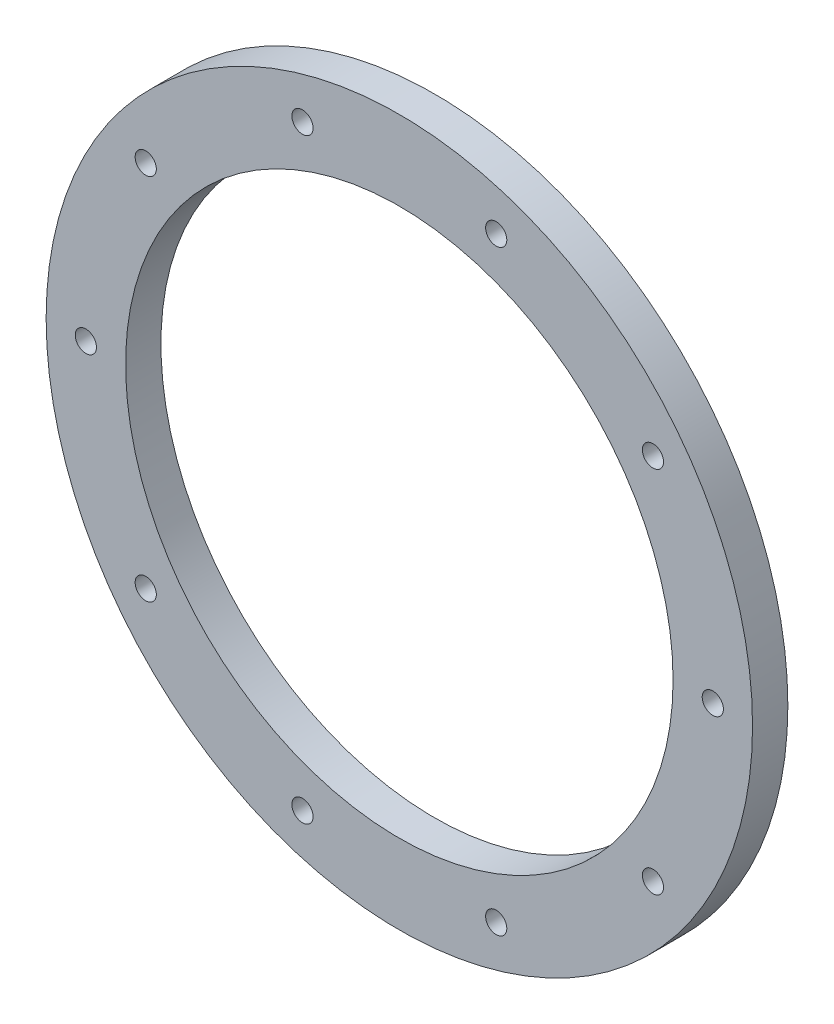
ISO-10303-21;
HEADER;
FILE_DESCRIPTION(('STEP AP214'),'2;1');
FILE_NAME('part.step','',(''),(''),'','','');
FILE_SCHEMA(('AUTOMOTIVE_DESIGN { 1 0 10303 214 1 1 1 1 }'));
ENDSEC;
DATA;
#1=APPLICATION_CONTEXT('core data for automotive mechanical design processes');
#2=APPLICATION_PROTOCOL_DEFINITION('international standard','automotive_design',2000,#1);
#3=PRODUCT_CONTEXT('',#1,'mechanical');
#4=PRODUCT('Part','Part','',(#3));
#5=PRODUCT_RELATED_PRODUCT_CATEGORY('part','',(#4));
#6=PRODUCT_DEFINITION_FORMATION('','',#4);
#7=PRODUCT_DEFINITION_CONTEXT('part definition',#1,'design');
#8=PRODUCT_DEFINITION('design','',#6,#7);
#9=PRODUCT_DEFINITION_SHAPE('','',#8);
#10=(LENGTH_UNIT() NAMED_UNIT(*) SI_UNIT(.MILLI.,.METRE.));
#11=(NAMED_UNIT(*) PLANE_ANGLE_UNIT() SI_UNIT($,.RADIAN.));
#12=(NAMED_UNIT(*) SI_UNIT($,.STERADIAN.) SOLID_ANGLE_UNIT());
#13=UNCERTAINTY_MEASURE_WITH_UNIT(LENGTH_MEASURE(1.E-05),#10,'distance_accuracy_value','');
#14=(GEOMETRIC_REPRESENTATION_CONTEXT(3) GLOBAL_UNCERTAINTY_ASSIGNED_CONTEXT((#13)) GLOBAL_UNIT_ASSIGNED_CONTEXT((#10,
#11,#12)) REPRESENTATION_CONTEXT('',''));
#15=CARTESIAN_POINT('',(0.,0.,0.));
#16=DIRECTION('',(0.,0.,1.));
#17=DIRECTION('',(1.,0.,0.));
#18=AXIS2_PLACEMENT_3D('',#15,#16,#17);
#19=CARTESIAN_POINT('',(0.,0.,20.));
#20=DIRECTION('',(0.,0.,1.));
#21=DIRECTION('',(1.,0.,0.));
#22=AXIS2_PLACEMENT_3D('',#19,#20,#21);
#23=PLANE('',#22);
#24=CARTESIAN_POINT('',(-143.600516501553,-104.331882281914,20.));
#25=DIRECTION('',(0.,0.,1.));
#26=DIRECTION('',(1.,0.,0.));
#27=AXIS2_PLACEMENT_3D('',#24,#25,#26);
#28=CIRCLE('',#27,6.00000000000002);
#29=CARTESIAN_POINT('',(-137.600516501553,-104.331882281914,20.));
#30=VERTEX_POINT('',#29);
#31=EDGE_CURVE('E84',#30,#30,#28,.T.);
#32=ORIENTED_EDGE('',*,*,#31,.F.);
#33=EDGE_LOOP('',(#32));
#34=FACE_BOUND('',#33,.T.);
#35=CARTESIAN_POINT('',(-54.8505165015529,-168.81253164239,20.));
#36=DIRECTION('',(0.,0.,1.));
#37=DIRECTION('',(1.,0.,0.));
#38=AXIS2_PLACEMENT_3D('',#35,#36,#37);
#39=CIRCLE('',#38,6.);
#40=CARTESIAN_POINT('',(-48.8505165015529,-168.81253164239,20.));
#41=VERTEX_POINT('',#40);
#42=EDGE_CURVE('E81',#41,#41,#39,.T.);
#43=ORIENTED_EDGE('',*,*,#42,.F.);
#44=EDGE_LOOP('',(#43));
#45=FACE_BOUND('',#44,.T.);
#46=CARTESIAN_POINT('',(54.8505165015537,-168.81253164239,20.));
#47=DIRECTION('',(0.,0.,1.));
#48=DIRECTION('',(1.,0.,0.));
#49=AXIS2_PLACEMENT_3D('',#46,#47,#48);
#50=CIRCLE('',#49,6.);
#51=CARTESIAN_POINT('',(60.8505165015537,-168.81253164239,20.));
#52=VERTEX_POINT('',#51);
#53=EDGE_CURVE('E78',#52,#52,#50,.T.);
#54=ORIENTED_EDGE('',*,*,#53,.F.);
#55=EDGE_LOOP('',(#54));
#56=FACE_BOUND('',#55,.T.);
#57=CARTESIAN_POINT('',(143.600516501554,-104.331882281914,20.));
#58=DIRECTION('',(0.,0.,1.));
#59=DIRECTION('',(1.,0.,0.));
#60=AXIS2_PLACEMENT_3D('',#57,#58,#59);
#61=CIRCLE('',#60,6.00000000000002);
#62=CARTESIAN_POINT('',(149.600516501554,-104.331882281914,20.));
#63=VERTEX_POINT('',#62);
#64=EDGE_CURVE('E74',#63,#63,#61,.T.);
#65=ORIENTED_EDGE('',*,*,#64,.F.);
#66=EDGE_LOOP('',(#65));
#67=FACE_BOUND('',#66,.T.);
#68=CARTESIAN_POINT('',(177.500000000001,0.,20.));
#69=DIRECTION('',(0.,0.,1.));
#70=DIRECTION('',(1.,0.,0.));
#71=AXIS2_PLACEMENT_3D('',#68,#69,#70);
#72=CIRCLE('',#71,6.00000000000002);
#73=CARTESIAN_POINT('',(183.500000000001,0.,20.));
#74=VERTEX_POINT('',#73);
#75=EDGE_CURVE('E70',#74,#74,#72,.T.);
#76=ORIENTED_EDGE('',*,*,#75,.F.);
#77=EDGE_LOOP('',(#76));
#78=FACE_BOUND('',#77,.T.);
#79=CARTESIAN_POINT('',(143.600516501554,104.331882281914,20.));
#80=DIRECTION('',(0.,0.,1.));
#81=DIRECTION('',(1.,0.,0.));
#82=AXIS2_PLACEMENT_3D('',#79,#80,#81);
#83=CIRCLE('',#82,6.00000000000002);
#84=CARTESIAN_POINT('',(149.600516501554,104.331882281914,20.));
#85=VERTEX_POINT('',#84);
#86=EDGE_CURVE('E66',#85,#85,#83,.T.);
#87=ORIENTED_EDGE('',*,*,#86,.F.);
#88=EDGE_LOOP('',(#87));
#89=FACE_BOUND('',#88,.T.);
#90=CARTESIAN_POINT('',(54.8505165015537,168.81253164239,20.));
#91=DIRECTION('',(0.,0.,1.));
#92=DIRECTION('',(1.,0.,0.));
#93=AXIS2_PLACEMENT_3D('',#90,#91,#92);
#94=CIRCLE('',#93,6.);
#95=CARTESIAN_POINT('',(60.8505165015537,168.81253164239,20.));
#96=VERTEX_POINT('',#95);
#97=EDGE_CURVE('E62',#96,#96,#94,.T.);
#98=ORIENTED_EDGE('',*,*,#97,.F.);
#99=EDGE_LOOP('',(#98));
#100=FACE_BOUND('',#99,.T.);
#101=CARTESIAN_POINT('',(-54.8505165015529,168.81253164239,20.));
#102=DIRECTION('',(0.,0.,1.));
#103=DIRECTION('',(1.,0.,0.));
#104=AXIS2_PLACEMENT_3D('',#101,#102,#103);
#105=CIRCLE('',#104,6.);
#106=CARTESIAN_POINT('',(-48.8505165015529,168.81253164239,20.));
#107=VERTEX_POINT('',#106);
#108=EDGE_CURVE('E58',#107,#107,#105,.T.);
#109=ORIENTED_EDGE('',*,*,#108,.F.);
#110=EDGE_LOOP('',(#109));
#111=FACE_BOUND('',#110,.T.);
#112=CARTESIAN_POINT('',(-143.600516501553,104.331882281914,20.));
#113=DIRECTION('',(0.,0.,1.));
#114=DIRECTION('',(1.,0.,0.));
#115=AXIS2_PLACEMENT_3D('',#112,#113,#114);
#116=CIRCLE('',#115,6.00000000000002);
#117=CARTESIAN_POINT('',(-137.600516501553,104.331882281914,20.));
#118=VERTEX_POINT('',#117);
#119=EDGE_CURVE('E54',#118,#118,#116,.T.);
#120=ORIENTED_EDGE('',*,*,#119,.F.);
#121=EDGE_LOOP('',(#120));
#122=FACE_BOUND('',#121,.T.);
#123=CARTESIAN_POINT('',(-177.5,0.,20.));
#124=DIRECTION('',(0.,0.,1.));
#125=DIRECTION('',(1.,0.,0.));
#126=AXIS2_PLACEMENT_3D('',#123,#124,#125);
#127=CIRCLE('',#126,6.00000000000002);
#128=CARTESIAN_POINT('',(-171.5,0.,20.));
#129=VERTEX_POINT('',#128);
#130=EDGE_CURVE('E53',#129,#129,#127,.T.);
#131=ORIENTED_EDGE('',*,*,#130,.F.);
#132=EDGE_LOOP('',(#131));
#133=FACE_BOUND('',#132,.T.);
#134=CARTESIAN_POINT('',(0.,0.,20.));
#135=DIRECTION('',(0.,0.,1.));
#136=DIRECTION('',(1.,0.,0.));
#137=AXIS2_PLACEMENT_3D('',#134,#135,#136);
#138=CIRCLE('',#137,200.);
#139=CARTESIAN_POINT('',(200.,0.,20.));
#140=VERTEX_POINT('',#139);
#141=EDGE_CURVE('E10',#140,#140,#138,.T.);
#142=ORIENTED_EDGE('',*,*,#141,.T.);
#143=EDGE_LOOP('',(#142));
#144=FACE_BOUND('',#143,.T.);
#145=CARTESIAN_POINT('',(0.,0.,20.));
#146=DIRECTION('',(0.,0.,1.));
#147=DIRECTION('',(1.,0.,0.));
#148=AXIS2_PLACEMENT_3D('',#145,#146,#147);
#149=CIRCLE('',#148,155.);
#150=CARTESIAN_POINT('',(155.,0.,20.));
#151=VERTEX_POINT('',#150);
#152=EDGE_CURVE('E44',#151,#151,#149,.T.);
#153=ORIENTED_EDGE('',*,*,#152,.F.);
#154=EDGE_LOOP('',(#153));
#155=FACE_BOUND('',#154,.T.);
#156=ADVANCED_FACE('F31',(#34,#45,#56,#67,#78,#89,#100,#111,#122,#133,#144,#155),#23,.T.);
#157=CARTESIAN_POINT('',(0.,0.,0.));
#158=DIRECTION('',(0.,0.,1.));
#159=DIRECTION('',(1.,0.,0.));
#160=AXIS2_PLACEMENT_3D('',#157,#158,#159);
#161=PLANE('',#160);
#162=CARTESIAN_POINT('',(-143.600516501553,-104.331882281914,0.));
#163=DIRECTION('',(0.,0.,1.));
#164=DIRECTION('',(1.,0.,0.));
#165=AXIS2_PLACEMENT_3D('',#162,#163,#164);
#166=CIRCLE('',#165,6.00000000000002);
#167=CARTESIAN_POINT('',(-137.600516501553,-104.331882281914,0.));
#168=VERTEX_POINT('',#167);
#169=EDGE_CURVE('E35',#168,#168,#166,.T.);
#170=ORIENTED_EDGE('',*,*,#169,.T.);
#171=EDGE_LOOP('',(#170));
#172=FACE_BOUND('',#171,.T.);
#173=CARTESIAN_POINT('',(-54.8505165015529,-168.81253164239,0.));
#174=DIRECTION('',(0.,0.,1.));
#175=DIRECTION('',(1.,0.,0.));
#176=AXIS2_PLACEMENT_3D('',#173,#174,#175);
#177=CIRCLE('',#176,6.);
#178=CARTESIAN_POINT('',(-48.8505165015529,-168.81253164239,0.));
#179=VERTEX_POINT('',#178);
#180=EDGE_CURVE('E82',#179,#179,#177,.T.);
#181=ORIENTED_EDGE('',*,*,#180,.T.);
#182=EDGE_LOOP('',(#181));
#183=FACE_BOUND('',#182,.T.);
#184=CARTESIAN_POINT('',(54.8505165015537,-168.81253164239,0.));
#185=DIRECTION('',(0.,0.,1.));
#186=DIRECTION('',(1.,0.,0.));
#187=AXIS2_PLACEMENT_3D('',#184,#185,#186);
#188=CIRCLE('',#187,6.);
#189=CARTESIAN_POINT('',(60.8505165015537,-168.81253164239,0.));
#190=VERTEX_POINT('',#189);
#191=EDGE_CURVE('E79',#190,#190,#188,.T.);
#192=ORIENTED_EDGE('',*,*,#191,.T.);
#193=EDGE_LOOP('',(#192));
#194=FACE_BOUND('',#193,.T.);
#195=CARTESIAN_POINT('',(143.600516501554,-104.331882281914,0.));
#196=DIRECTION('',(0.,0.,1.));
#197=DIRECTION('',(1.,0.,0.));
#198=AXIS2_PLACEMENT_3D('',#195,#196,#197);
#199=CIRCLE('',#198,6.00000000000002);
#200=CARTESIAN_POINT('',(149.600516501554,-104.331882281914,0.));
#201=VERTEX_POINT('',#200);
#202=EDGE_CURVE('E75',#201,#201,#199,.T.);
#203=ORIENTED_EDGE('',*,*,#202,.T.);
#204=EDGE_LOOP('',(#203));
#205=FACE_BOUND('',#204,.T.);
#206=CARTESIAN_POINT('',(177.500000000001,0.,0.));
#207=DIRECTION('',(0.,0.,1.));
#208=DIRECTION('',(1.,0.,0.));
#209=AXIS2_PLACEMENT_3D('',#206,#207,#208);
#210=CIRCLE('',#209,6.00000000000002);
#211=CARTESIAN_POINT('',(183.500000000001,0.,0.));
#212=VERTEX_POINT('',#211);
#213=EDGE_CURVE('E71',#212,#212,#210,.T.);
#214=ORIENTED_EDGE('',*,*,#213,.T.);
#215=EDGE_LOOP('',(#214));
#216=FACE_BOUND('',#215,.T.);
#217=CARTESIAN_POINT('',(143.600516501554,104.331882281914,0.));
#218=DIRECTION('',(0.,0.,1.));
#219=DIRECTION('',(1.,0.,0.));
#220=AXIS2_PLACEMENT_3D('',#217,#218,#219);
#221=CIRCLE('',#220,6.00000000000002);
#222=CARTESIAN_POINT('',(149.600516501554,104.331882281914,0.));
#223=VERTEX_POINT('',#222);
#224=EDGE_CURVE('E67',#223,#223,#221,.T.);
#225=ORIENTED_EDGE('',*,*,#224,.T.);
#226=EDGE_LOOP('',(#225));
#227=FACE_BOUND('',#226,.T.);
#228=CARTESIAN_POINT('',(54.8505165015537,168.81253164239,0.));
#229=DIRECTION('',(0.,0.,1.));
#230=DIRECTION('',(1.,0.,0.));
#231=AXIS2_PLACEMENT_3D('',#228,#229,#230);
#232=CIRCLE('',#231,6.);
#233=CARTESIAN_POINT('',(60.8505165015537,168.81253164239,0.));
#234=VERTEX_POINT('',#233);
#235=EDGE_CURVE('E63',#234,#234,#232,.T.);
#236=ORIENTED_EDGE('',*,*,#235,.T.);
#237=EDGE_LOOP('',(#236));
#238=FACE_BOUND('',#237,.T.);
#239=CARTESIAN_POINT('',(-54.8505165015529,168.81253164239,0.));
#240=DIRECTION('',(0.,0.,1.));
#241=DIRECTION('',(1.,0.,0.));
#242=AXIS2_PLACEMENT_3D('',#239,#240,#241);
#243=CIRCLE('',#242,6.);
#244=CARTESIAN_POINT('',(-48.8505165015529,168.81253164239,0.));
#245=VERTEX_POINT('',#244);
#246=EDGE_CURVE('E59',#245,#245,#243,.T.);
#247=ORIENTED_EDGE('',*,*,#246,.T.);
#248=EDGE_LOOP('',(#247));
#249=FACE_BOUND('',#248,.T.);
#250=CARTESIAN_POINT('',(-143.600516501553,104.331882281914,0.));
#251=DIRECTION('',(0.,0.,1.));
#252=DIRECTION('',(1.,0.,0.));
#253=AXIS2_PLACEMENT_3D('',#250,#251,#252);
#254=CIRCLE('',#253,6.00000000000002);
#255=CARTESIAN_POINT('',(-137.600516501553,104.331882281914,0.));
#256=VERTEX_POINT('',#255);
#257=EDGE_CURVE('E55',#256,#256,#254,.T.);
#258=ORIENTED_EDGE('',*,*,#257,.T.);
#259=EDGE_LOOP('',(#258));
#260=FACE_BOUND('',#259,.T.);
#261=CARTESIAN_POINT('',(-177.5,0.,0.));
#262=DIRECTION('',(0.,0.,1.));
#263=DIRECTION('',(1.,0.,0.));
#264=AXIS2_PLACEMENT_3D('',#261,#262,#263);
#265=CIRCLE('',#264,6.00000000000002);
#266=CARTESIAN_POINT('',(-171.5,0.,0.));
#267=VERTEX_POINT('',#266);
#268=EDGE_CURVE('E50',#267,#267,#265,.T.);
#269=ORIENTED_EDGE('',*,*,#268,.T.);
#270=EDGE_LOOP('',(#269));
#271=FACE_BOUND('',#270,.T.);
#272=CARTESIAN_POINT('',(0.,0.,0.));
#273=DIRECTION('',(0.,0.,1.));
#274=DIRECTION('',(1.,0.,0.));
#275=AXIS2_PLACEMENT_3D('',#272,#273,#274);
#276=CIRCLE('',#275,200.);
#277=CARTESIAN_POINT('',(200.,0.,0.));
#278=VERTEX_POINT('',#277);
#279=EDGE_CURVE('E39',#278,#278,#276,.T.);
#280=ORIENTED_EDGE('',*,*,#279,.F.);
#281=EDGE_LOOP('',(#280));
#282=FACE_BOUND('',#281,.T.);
#283=CARTESIAN_POINT('',(0.,0.,0.));
#284=DIRECTION('',(0.,0.,1.));
#285=DIRECTION('',(1.,0.,0.));
#286=AXIS2_PLACEMENT_3D('',#283,#284,#285);
#287=CIRCLE('',#286,155.);
#288=CARTESIAN_POINT('',(155.,0.,0.));
#289=VERTEX_POINT('',#288);
#290=EDGE_CURVE('E47',#289,#289,#287,.T.);
#291=ORIENTED_EDGE('',*,*,#290,.T.);
#292=EDGE_LOOP('',(#291));
#293=FACE_BOUND('',#292,.T.);
#294=ADVANCED_FACE('F116',(#172,#183,#194,#205,#216,#227,#238,#249,#260,#271,#282,#293),#161,.F.);
#295=CARTESIAN_POINT('',(0.,0.,20.));
#296=DIRECTION('',(0.,0.,-1.));
#297=DIRECTION('',(-1.,0.,0.));
#298=AXIS2_PLACEMENT_3D('',#295,#296,#297);
#299=CYLINDRICAL_SURFACE('',#298,200.);
#300=ORIENTED_EDGE('',*,*,#141,.F.);
#301=EDGE_LOOP('',(#300));
#302=FACE_BOUND('',#301,.T.);
#303=ORIENTED_EDGE('',*,*,#279,.T.);
#304=EDGE_LOOP('',(#303));
#305=FACE_BOUND('',#304,.T.);
#306=ADVANCED_FACE('F33',(#302,#305),#299,.T.);
#307=CARTESIAN_POINT('',(0.,0.,20.));
#308=DIRECTION('',(0.,0.,-1.));
#309=DIRECTION('',(-1.,0.,0.));
#310=AXIS2_PLACEMENT_3D('',#307,#308,#309);
#311=CYLINDRICAL_SURFACE('',#310,155.);
#312=ORIENTED_EDGE('',*,*,#152,.T.);
#313=EDGE_LOOP('',(#312));
#314=FACE_BOUND('',#313,.T.);
#315=ORIENTED_EDGE('',*,*,#290,.F.);
#316=EDGE_LOOP('',(#315));
#317=FACE_BOUND('',#316,.T.);
#318=ADVANCED_FACE('F118',(#314,#317),#311,.F.);
#319=CARTESIAN_POINT('',(-177.5,0.,-30.));
#320=DIRECTION('',(0.,0.,1.));
#321=DIRECTION('',(1.,0.,0.));
#322=AXIS2_PLACEMENT_3D('',#319,#320,#321);
#323=CYLINDRICAL_SURFACE('',#322,6.00000000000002);
#324=ORIENTED_EDGE('',*,*,#130,.T.);
#325=EDGE_LOOP('',(#324));
#326=FACE_BOUND('',#325,.T.);
#327=ORIENTED_EDGE('',*,*,#268,.F.);
#328=EDGE_LOOP('',(#327));
#329=FACE_BOUND('',#328,.T.);
#330=ADVANCED_FACE('F120',(#326,#329),#323,.F.);
#331=CARTESIAN_POINT('',(-143.600516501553,104.331882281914,-30.));
#332=DIRECTION('',(0.,0.,1.));
#333=DIRECTION('',(1.,0.,0.));
#334=AXIS2_PLACEMENT_3D('',#331,#332,#333);
#335=CYLINDRICAL_SURFACE('',#334,6.00000000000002);
#336=ORIENTED_EDGE('',*,*,#119,.T.);
#337=EDGE_LOOP('',(#336));
#338=FACE_BOUND('',#337,.T.);
#339=ORIENTED_EDGE('',*,*,#257,.F.);
#340=EDGE_LOOP('',(#339));
#341=FACE_BOUND('',#340,.T.);
#342=ADVANCED_FACE('F126',(#338,#341),#335,.F.);
#343=CARTESIAN_POINT('',(-54.8505165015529,168.81253164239,-30.));
#344=DIRECTION('',(0.,0.,1.));
#345=DIRECTION('',(1.,0.,0.));
#346=AXIS2_PLACEMENT_3D('',#343,#344,#345);
#347=CYLINDRICAL_SURFACE('',#346,6.);
#348=ORIENTED_EDGE('',*,*,#108,.T.);
#349=EDGE_LOOP('',(#348));
#350=FACE_BOUND('',#349,.T.);
#351=ORIENTED_EDGE('',*,*,#246,.F.);
#352=EDGE_LOOP('',(#351));
#353=FACE_BOUND('',#352,.T.);
#354=ADVANCED_FACE('F165',(#350,#353),#347,.F.);
#355=CARTESIAN_POINT('',(54.8505165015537,168.81253164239,-30.));
#356=DIRECTION('',(0.,0.,1.));
#357=DIRECTION('',(1.,0.,0.));
#358=AXIS2_PLACEMENT_3D('',#355,#356,#357);
#359=CYLINDRICAL_SURFACE('',#358,6.);
#360=ORIENTED_EDGE('',*,*,#97,.T.);
#361=EDGE_LOOP('',(#360));
#362=FACE_BOUND('',#361,.T.);
#363=ORIENTED_EDGE('',*,*,#235,.F.);
#364=EDGE_LOOP('',(#363));
#365=FACE_BOUND('',#364,.T.);
#366=ADVANCED_FACE('F172',(#362,#365),#359,.F.);
#367=CARTESIAN_POINT('',(143.600516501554,104.331882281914,-30.));
#368=DIRECTION('',(0.,0.,1.));
#369=DIRECTION('',(1.,0.,0.));
#370=AXIS2_PLACEMENT_3D('',#367,#368,#369);
#371=CYLINDRICAL_SURFACE('',#370,6.00000000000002);
#372=ORIENTED_EDGE('',*,*,#86,.T.);
#373=EDGE_LOOP('',(#372));
#374=FACE_BOUND('',#373,.T.);
#375=ORIENTED_EDGE('',*,*,#224,.F.);
#376=EDGE_LOOP('',(#375));
#377=FACE_BOUND('',#376,.T.);
#378=ADVANCED_FACE('F178',(#374,#377),#371,.F.);
#379=CARTESIAN_POINT('',(177.500000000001,0.,-30.));
#380=DIRECTION('',(0.,0.,1.));
#381=DIRECTION('',(1.,0.,0.));
#382=AXIS2_PLACEMENT_3D('',#379,#380,#381);
#383=CYLINDRICAL_SURFACE('',#382,6.00000000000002);
#384=ORIENTED_EDGE('',*,*,#75,.T.);
#385=EDGE_LOOP('',(#384));
#386=FACE_BOUND('',#385,.T.);
#387=ORIENTED_EDGE('',*,*,#213,.F.);
#388=EDGE_LOOP('',(#387));
#389=FACE_BOUND('',#388,.T.);
#390=ADVANCED_FACE('F182',(#386,#389),#383,.F.);
#391=CARTESIAN_POINT('',(143.600516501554,-104.331882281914,-30.));
#392=DIRECTION('',(0.,0.,1.));
#393=DIRECTION('',(1.,0.,0.));
#394=AXIS2_PLACEMENT_3D('',#391,#392,#393);
#395=CYLINDRICAL_SURFACE('',#394,6.00000000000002);
#396=ORIENTED_EDGE('',*,*,#64,.T.);
#397=EDGE_LOOP('',(#396));
#398=FACE_BOUND('',#397,.T.);
#399=ORIENTED_EDGE('',*,*,#202,.F.);
#400=EDGE_LOOP('',(#399));
#401=FACE_BOUND('',#400,.T.);
#402=ADVANCED_FACE('F186',(#398,#401),#395,.F.);
#403=CARTESIAN_POINT('',(54.8505165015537,-168.81253164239,-30.));
#404=DIRECTION('',(0.,0.,1.));
#405=DIRECTION('',(1.,0.,0.));
#406=AXIS2_PLACEMENT_3D('',#403,#404,#405);
#407=CYLINDRICAL_SURFACE('',#406,6.);
#408=ORIENTED_EDGE('',*,*,#53,.T.);
#409=EDGE_LOOP('',(#408));
#410=FACE_BOUND('',#409,.T.);
#411=ORIENTED_EDGE('',*,*,#191,.F.);
#412=EDGE_LOOP('',(#411));
#413=FACE_BOUND('',#412,.T.);
#414=ADVANCED_FACE('F190',(#410,#413),#407,.F.);
#415=CARTESIAN_POINT('',(-54.8505165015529,-168.81253164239,-30.));
#416=DIRECTION('',(0.,0.,1.));
#417=DIRECTION('',(1.,0.,0.));
#418=AXIS2_PLACEMENT_3D('',#415,#416,#417);
#419=CYLINDRICAL_SURFACE('',#418,6.);
#420=ORIENTED_EDGE('',*,*,#42,.T.);
#421=EDGE_LOOP('',(#420));
#422=FACE_BOUND('',#421,.T.);
#423=ORIENTED_EDGE('',*,*,#180,.F.);
#424=EDGE_LOOP('',(#423));
#425=FACE_BOUND('',#424,.T.);
#426=ADVANCED_FACE('F194',(#422,#425),#419,.F.);
#427=CARTESIAN_POINT('',(-143.600516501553,-104.331882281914,-30.));
#428=DIRECTION('',(0.,0.,1.));
#429=DIRECTION('',(1.,0.,0.));
#430=AXIS2_PLACEMENT_3D('',#427,#428,#429);
#431=CYLINDRICAL_SURFACE('',#430,6.00000000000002);
#432=ORIENTED_EDGE('',*,*,#31,.T.);
#433=EDGE_LOOP('',(#432));
#434=FACE_BOUND('',#433,.T.);
#435=ORIENTED_EDGE('',*,*,#169,.F.);
#436=EDGE_LOOP('',(#435));
#437=FACE_BOUND('',#436,.T.);
#438=ADVANCED_FACE('F198',(#434,#437),#431,.F.);
#439=CLOSED_SHELL('',(#156,#294,#306,#318,#330,#342,#354,#366,#378,#390,#402,#414,#426,#438));
#440=MANIFOLD_SOLID_BREP('B2',#439);
#441=ADVANCED_BREP_SHAPE_REPRESENTATION('',(#18,#440),#14);
#442=SHAPE_DEFINITION_REPRESENTATION(#9,#441);
ENDSEC;
END-ISO-10303-21;
